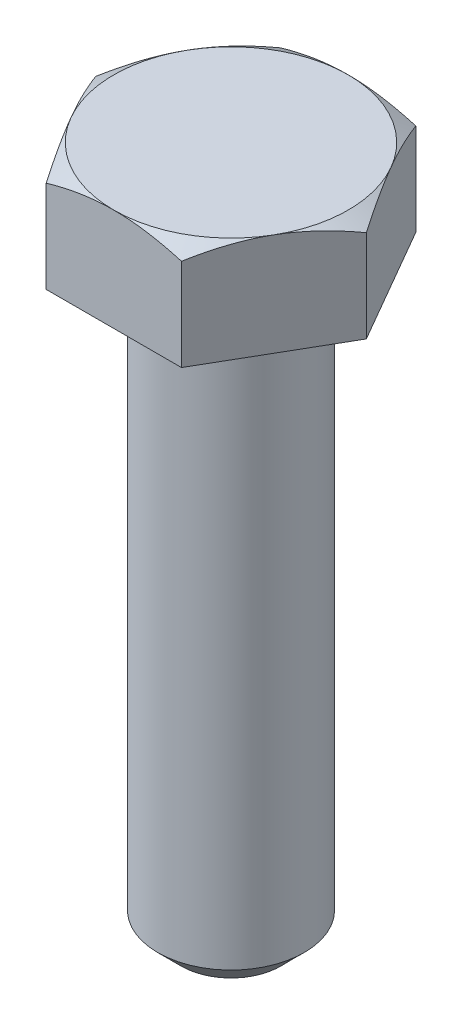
ISO-10303-21;
HEADER;
FILE_DESCRIPTION(('STEP AP214'),'2;1');
FILE_NAME('part.step','',(''),(''),'','','');
FILE_SCHEMA(('AUTOMOTIVE_DESIGN { 1 0 10303 214 1 1 1 1 }'));
ENDSEC;
DATA;
#1=APPLICATION_CONTEXT('core data for automotive mechanical design processes');
#2=APPLICATION_PROTOCOL_DEFINITION('international standard','automotive_design',2000,#1);
#3=PRODUCT_CONTEXT('',#1,'mechanical');
#4=PRODUCT('Part','Part','',(#3));
#5=PRODUCT_RELATED_PRODUCT_CATEGORY('part','',(#4));
#6=PRODUCT_DEFINITION_FORMATION('','',#4);
#7=PRODUCT_DEFINITION_CONTEXT('part definition',#1,'design');
#8=PRODUCT_DEFINITION('design','',#6,#7);
#9=PRODUCT_DEFINITION_SHAPE('','',#8);
#10=(LENGTH_UNIT() NAMED_UNIT(*) SI_UNIT(.MILLI.,.METRE.));
#11=(NAMED_UNIT(*) PLANE_ANGLE_UNIT() SI_UNIT($,.RADIAN.));
#12=(NAMED_UNIT(*) SI_UNIT($,.STERADIAN.) SOLID_ANGLE_UNIT());
#13=UNCERTAINTY_MEASURE_WITH_UNIT(LENGTH_MEASURE(1.E-05),#10,'distance_accuracy_value','');
#14=(GEOMETRIC_REPRESENTATION_CONTEXT(3) GLOBAL_UNCERTAINTY_ASSIGNED_CONTEXT((#13)) GLOBAL_UNIT_ASSIGNED_CONTEXT((#10,
#11,#12)) REPRESENTATION_CONTEXT('',''));
#15=CARTESIAN_POINT('',(0.,0.,0.));
#16=DIRECTION('',(0.,0.,1.));
#17=DIRECTION('',(1.,0.,0.));
#18=AXIS2_PLACEMENT_3D('',#15,#16,#17);
#19=CARTESIAN_POINT('',(0.,3.5,0.));
#20=DIRECTION('',(0.,-1.,0.));
#21=DIRECTION('',(1.,0.,0.));
#22=AXIS2_PLACEMENT_3D('',#19,#20,#21);
#23=PLANE('',#22);
#24=CARTESIAN_POINT('',(0.,3.50000000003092,0.));
#25=DIRECTION('',(0.,-1.,0.));
#26=DIRECTION('',(0.,0.,-1.));
#27=AXIS2_PLACEMENT_3D('',#24,#25,#26);
#28=CIRCLE('',#27,3.99999999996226);
#29=CARTESIAN_POINT('',(3.4641016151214,3.50000000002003,1.99999999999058));
#30=VERTEX_POINT('',#29);
#31=CARTESIAN_POINT('',(0.,3.50000000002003,3.99999999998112));
#32=VERTEX_POINT('',#31);
#33=EDGE_CURVE('E89',#30,#32,#28,.T.);
#34=ORIENTED_EDGE('',*,*,#33,.F.);
#35=CARTESIAN_POINT('',(0.,3.50000000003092,0.));
#36=DIRECTION('',(0.,-1.,0.));
#37=DIRECTION('',(0.,0.,-1.));
#38=AXIS2_PLACEMENT_3D('',#35,#36,#37);
#39=CIRCLE('',#38,3.99999999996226);
#40=CARTESIAN_POINT('',(3.4641016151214,3.50000000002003,-1.99999999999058));
#41=VERTEX_POINT('',#40);
#42=EDGE_CURVE('E87',#41,#30,#39,.T.);
#43=ORIENTED_EDGE('',*,*,#42,.F.);
#44=CARTESIAN_POINT('',(0.,3.50000000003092,0.));
#45=DIRECTION('',(0.,-1.,0.));
#46=DIRECTION('',(0.,0.,-1.));
#47=AXIS2_PLACEMENT_3D('',#44,#45,#46);
#48=CIRCLE('',#47,3.99999999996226);
#49=CARTESIAN_POINT('',(0.,3.50000000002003,-3.99999999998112));
#50=VERTEX_POINT('',#49);
#51=EDGE_CURVE('E20',#50,#41,#48,.T.);
#52=ORIENTED_EDGE('',*,*,#51,.F.);
#53=CARTESIAN_POINT('',(0.,3.50000000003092,0.));
#54=DIRECTION('',(0.,-1.,0.));
#55=DIRECTION('',(0.,0.,-1.));
#56=AXIS2_PLACEMENT_3D('',#53,#54,#55);
#57=CIRCLE('',#56,3.99999999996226);
#58=CARTESIAN_POINT('',(-3.4641016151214,3.50000000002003,-1.99999999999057));
#59=VERTEX_POINT('',#58);
#60=EDGE_CURVE('E104',#59,#50,#57,.T.);
#61=ORIENTED_EDGE('',*,*,#60,.F.);
#62=CARTESIAN_POINT('',(0.,3.50000000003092,0.));
#63=DIRECTION('',(0.,-1.,0.));
#64=DIRECTION('',(0.,0.,-1.));
#65=AXIS2_PLACEMENT_3D('',#62,#63,#64);
#66=CIRCLE('',#65,3.99999999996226);
#67=CARTESIAN_POINT('',(-3.4641016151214,3.50000000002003,1.99999999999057));
#68=VERTEX_POINT('',#67);
#69=EDGE_CURVE('E323',#68,#59,#66,.T.);
#70=ORIENTED_EDGE('',*,*,#69,.F.);
#71=CARTESIAN_POINT('',(0.,3.50000000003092,0.));
#72=DIRECTION('',(0.,-1.,0.));
#73=DIRECTION('',(0.,0.,-1.));
#74=AXIS2_PLACEMENT_3D('',#71,#72,#73);
#75=CIRCLE('',#74,3.99999999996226);
#76=EDGE_CURVE('E93',#32,#68,#75,.T.);
#77=ORIENTED_EDGE('',*,*,#76,.F.);
#78=EDGE_LOOP('',(#34,#43,#52,#61,#70,#77));
#79=FACE_BOUND('',#78,.T.);
#80=ADVANCED_FACE('F16',(#79),#23,.F.);
#81=CARTESIAN_POINT('',(0.,3.14059081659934,0.));
#82=DIRECTION('',(0.,-1.,0.));
#83=DIRECTION('',(0.,0.,-1.));
#84=AXIS2_PLACEMENT_3D('',#81,#82,#83);
#85=CONICAL_SURFACE('',#84,4.62251496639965,1.04719755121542);
#86=ORIENTED_EDGE('',*,*,#51,.T.);
#87=CARTESIAN_POINT('',(2.30940107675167,3.14273441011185,-4.00000000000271));
#88=CARTESIAN_POINT('',(2.4033932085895,3.19701440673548,-3.8372008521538));
#89=CARTESIAN_POINT('',(2.49813806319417,3.24674436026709,-3.67309795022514));
#90=CARTESIAN_POINT('',(2.68846293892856,3.33444223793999,-3.34344559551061));
#91=CARTESIAN_POINT('',(2.78403632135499,3.37246832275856,-3.17790764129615));
#92=CARTESIAN_POINT('',(2.92829837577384,3.41915789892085,-2.9280384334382));
#93=CARTESIAN_POINT('',(2.97656796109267,3.43300183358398,-2.84443305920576));
#94=CARTESIAN_POINT('',(3.07333821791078,3.45696597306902,-2.67682205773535));
#95=CARTESIAN_POINT('',(3.12183888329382,3.46708627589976,-2.59281644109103));
#96=CARTESIAN_POINT('',(3.21925069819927,3.48342533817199,-2.42409422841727));
#97=CARTESIAN_POINT('',(3.26816268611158,3.4896242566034,-2.33937618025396));
#98=CARTESIAN_POINT('',(3.36608285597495,3.49792016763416,-2.16977347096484));
#99=CARTESIAN_POINT('',(3.41509105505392,3.50001634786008,-2.08488878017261));
#100=CARTESIAN_POINT('',(3.46410161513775,3.50000000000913,-2.00000000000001));
#101=B_SPLINE_CURVE_WITH_KNOTS('',3,(#87,#88,#89,#90,#91,#92,#93,#94,#95,#96,#97,#98,#99,#100),
.UNSPECIFIED.,.F.,.F.,(4,2,2,2,2,2,4),(0.,0.587229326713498,1.17149154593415,1.4640059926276,
1.75651273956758,2.05048788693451,2.3445212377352),.UNSPECIFIED.);
#102=CARTESIAN_POINT('',(2.30940107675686,3.14273441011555,-4.00000000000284));
#103=VERTEX_POINT('',#102);
#104=EDGE_CURVE('E99',#103,#41,#101,.T.);
#105=ORIENTED_EDGE('',*,*,#104,.F.);
#106=CARTESIAN_POINT('',(0.,3.50000000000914,-3.99999999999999));
#107=CARTESIAN_POINT('',(0.0980211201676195,3.50001634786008,-3.99999999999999));
#108=CARTESIAN_POINT('',(0.196037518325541,3.49792016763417,-3.99999999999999));
#109=CARTESIAN_POINT('',(0.39187785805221,3.48962425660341,-3.99999999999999));
#110=CARTESIAN_POINT('',(0.489701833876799,3.48342533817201,-3.99999999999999));
#111=CARTESIAN_POINT('',(0.684525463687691,3.46708627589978,-3.99999999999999));
#112=CARTESIAN_POINT('',(0.781526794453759,3.45696597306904,-3.99999999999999));
#113=CARTESIAN_POINT('',(0.975067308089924,3.43300183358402,-3.99999999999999));
#114=CARTESIAN_POINT('',(1.07160647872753,3.41915789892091,-3.99999999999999));
#115=CARTESIAN_POINT('',(1.36013058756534,3.37246832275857,-3.99999999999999));
#116=CARTESIAN_POINT('',(1.55127735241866,3.33444223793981,-3.99999999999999));
#117=CARTESIAN_POINT('',(1.93192710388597,3.24674436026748,-3.99999999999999));
#118=CARTESIAN_POINT('',(2.12141681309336,3.19701440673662,-3.99999999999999));
#119=CARTESIAN_POINT('',(2.30940107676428,3.14273441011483,-3.99999999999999));
#120=B_SPLINE_CURVE_WITH_KNOTS('',3,(#106,#107,#108,#109,#110,#111,#112,#113,#114,#115,#116,
#117,#118,#119),.UNSPECIFIED.,.F.,.F.,(4,2,2,2,2,2,4),(0.,0.294033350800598,0.588008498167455,
0.880515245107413,1.17302969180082,1.75729191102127,2.34452123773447),.UNSPECIFIED.);
#121=EDGE_CURVE('E102',#50,#103,#120,.T.);
#122=ORIENTED_EDGE('',*,*,#121,.F.);
#123=EDGE_LOOP('',(#86,#105,#122));
#124=FACE_BOUND('',#123,.T.);
#125=ADVANCED_FACE('F97',(#124),#85,.T.);
#126=CARTESIAN_POINT('',(0.,3.14059081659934,0.));
#127=DIRECTION('',(0.,-1.,0.));
#128=DIRECTION('',(0.,0.,-1.));
#129=AXIS2_PLACEMENT_3D('',#126,#127,#128);
#130=CONICAL_SURFACE('',#129,4.62251496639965,1.04719755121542);
#131=ORIENTED_EDGE('',*,*,#60,.T.);
#132=CARTESIAN_POINT('',(-2.30940107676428,3.14273441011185,-3.99999999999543));
#133=CARTESIAN_POINT('',(-2.12141681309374,3.19701440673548,-3.9999999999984));
#134=CARTESIAN_POINT('',(-1.93192710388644,3.24674436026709,-3.99999999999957));
#135=CARTESIAN_POINT('',(-1.55127735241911,3.33444223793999,-4.0000000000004));
#136=CARTESIAN_POINT('',(-1.36013058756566,3.37246832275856,-4.00000000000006));
#137=CARTESIAN_POINT('',(-1.07160647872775,3.41915789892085,-3.99999999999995));
#138=CARTESIAN_POINT('',(-0.975067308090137,3.43300183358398,-3.99999999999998));
#139=CARTESIAN_POINT('',(-0.781526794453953,3.45696597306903,-4.));
#140=CARTESIAN_POINT('',(-0.684525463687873,3.46708627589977,-3.99999999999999));
#141=CARTESIAN_POINT('',(-0.489701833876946,3.483425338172,-3.99999999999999));
#142=CARTESIAN_POINT('',(-0.391877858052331,3.4896242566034,-3.99999999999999));
#143=CARTESIAN_POINT('',(-0.196037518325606,3.49792016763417,-3.99999999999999));
#144=CARTESIAN_POINT('',(-0.098021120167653,3.50001634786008,-3.99999999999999));
#145=CARTESIAN_POINT('',(0.,3.50000000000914,-3.99999999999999));
#146=B_SPLINE_CURVE_WITH_KNOTS('',3,(#132,#133,#134,#135,#136,#137,#138,#139,#140,#141,#142,
#143,#144,#145),.UNSPECIFIED.,.F.,.F.,(4,2,2,2,2,2,4),(0.,0.587229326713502,1.17149154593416,
1.46400599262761,1.75651273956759,2.05048788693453,2.34452123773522),.UNSPECIFIED.);
#147=CARTESIAN_POINT('',(-2.30940107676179,3.14273441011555,-3.99999999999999));
#148=VERTEX_POINT('',#147);
#149=EDGE_CURVE('E113',#148,#50,#146,.T.);
#150=ORIENTED_EDGE('',*,*,#149,.F.);
#151=CARTESIAN_POINT('',(-3.46410161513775,3.50000000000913,-2.00000000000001));
#152=CARTESIAN_POINT('',(-3.41509105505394,3.50001634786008,-2.08488878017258));
#153=CARTESIAN_POINT('',(-3.36608285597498,3.49792016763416,-2.16977347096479));
#154=CARTESIAN_POINT('',(-3.26816268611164,3.4896242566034,-2.33937618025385));
#155=CARTESIAN_POINT('',(-3.21925069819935,3.483425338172,-2.42409422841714));
#156=CARTESIAN_POINT('',(-3.1218388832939,3.46708627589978,-2.59281644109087));
#157=CARTESIAN_POINT('',(-3.07333821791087,3.45696597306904,-2.67682205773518));
#158=CARTESIAN_POINT('',(-2.97656796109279,3.43300183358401,-2.84443305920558));
#159=CARTESIAN_POINT('',(-2.92829837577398,3.41915789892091,-2.92803843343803));
#160=CARTESIAN_POINT('',(-2.78403632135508,3.37246832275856,-3.17790764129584));
#161=CARTESIAN_POINT('',(-2.68846293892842,3.33444223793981,-3.34344559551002));
#162=CARTESIAN_POINT('',(-2.49813806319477,3.24674436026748,-3.67309795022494));
#163=CARTESIAN_POINT('',(-2.40339320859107,3.19701440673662,-3.83720085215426));
#164=CARTESIAN_POINT('',(-2.30940107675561,3.14273441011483,-4.00000000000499));
#165=B_SPLINE_CURVE_WITH_KNOTS('',3,(#151,#152,#153,#154,#155,#156,#157,#158,#159,#160,#161,
#162,#163,#164),.UNSPECIFIED.,.F.,.F.,(4,2,2,2,2,2,4),(0.,0.294033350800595,0.58800849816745,
0.880515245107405,1.17302969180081,1.75729191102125,2.34452123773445),.UNSPECIFIED.);
#166=EDGE_CURVE('E169',#59,#148,#165,.T.);
#167=ORIENTED_EDGE('',*,*,#166,.F.);
#168=EDGE_LOOP('',(#131,#150,#167));
#169=FACE_BOUND('',#168,.T.);
#170=ADVANCED_FACE('F137',(#169),#130,.T.);
#171=CARTESIAN_POINT('',(0.,3.14059081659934,0.));
#172=DIRECTION('',(0.,-1.,0.));
#173=DIRECTION('',(0.,0.,-1.));
#174=AXIS2_PLACEMENT_3D('',#171,#172,#173);
#175=CONICAL_SURFACE('',#174,4.62251496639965,1.04719755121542);
#176=ORIENTED_EDGE('',*,*,#69,.T.);
#177=CARTESIAN_POINT('',(-4.61880215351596,3.14273441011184,7.2818296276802E-12));
#178=CARTESIAN_POINT('',(-4.52481002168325,3.19701440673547,-0.162799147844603));
#179=CARTESIAN_POINT('',(-4.43006516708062,3.24674436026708,-0.326902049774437));
#180=CARTESIAN_POINT('',(-4.23974029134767,3.33444223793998,-0.656554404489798));
#181=CARTESIAN_POINT('',(-4.14416690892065,3.37246832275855,-0.822092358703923));
#182=CARTESIAN_POINT('',(-3.9999048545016,3.41915789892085,-1.07196156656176));
#183=CARTESIAN_POINT('',(-3.95163526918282,3.43300183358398,-1.15556694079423));
#184=CARTESIAN_POINT('',(-3.85486501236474,3.45696597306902,-1.32317794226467));
#185=CARTESIAN_POINT('',(-3.80636434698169,3.46708627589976,-1.40718355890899));
#186=CARTESIAN_POINT('',(-3.70895253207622,3.48342533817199,-1.57590577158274));
#187=CARTESIAN_POINT('',(-3.66004054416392,3.4896242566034,-1.66062381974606));
#188=CARTESIAN_POINT('',(-3.56212037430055,3.49792016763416,-1.83022652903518));
#189=CARTESIAN_POINT('',(-3.51311217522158,3.50001634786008,-1.91511121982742));
#190=CARTESIAN_POINT('',(-3.46410161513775,3.50000000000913,-2.00000000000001));
#191=B_SPLINE_CURVE_WITH_KNOTS('',3,(#177,#178,#179,#180,#181,#182,#183,#184,#185,#186,#187,
#188,#189,#190),.UNSPECIFIED.,.F.,.F.,(4,2,2,2,2,2,4),(0.,0.587229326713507,1.17149154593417,
1.46400599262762,1.75651273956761,2.05048788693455,2.34452123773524),.UNSPECIFIED.);
#192=CARTESIAN_POINT('',(-4.61880215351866,3.14273441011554,2.84537209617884E-12));
#193=VERTEX_POINT('',#192);
#194=EDGE_CURVE('E146',#193,#59,#191,.T.);
#195=ORIENTED_EDGE('',*,*,#194,.F.);
#196=CARTESIAN_POINT('',(-3.46410161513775,3.50000000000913,2.00000000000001));
#197=CARTESIAN_POINT('',(-3.51311217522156,3.50001634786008,1.91511121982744));
#198=CARTESIAN_POINT('',(-3.56212037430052,3.49792016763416,1.83022652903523));
#199=CARTESIAN_POINT('',(-3.66004054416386,3.4896242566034,1.66062381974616));
#200=CARTESIAN_POINT('',(-3.70895253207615,3.483425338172,1.57590577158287));
#201=CARTESIAN_POINT('',(-3.8063643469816,3.46708627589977,1.40718355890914));
#202=CARTESIAN_POINT('',(-3.85486501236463,3.45696597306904,1.32317794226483));
#203=CARTESIAN_POINT('',(-3.95163526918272,3.43300183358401,1.15556694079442));
#204=CARTESIAN_POINT('',(-3.99990485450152,3.4191578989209,1.07196156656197));
#205=CARTESIAN_POINT('',(-4.14416690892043,3.37246832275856,0.822092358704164));
#206=CARTESIAN_POINT('',(-4.23974029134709,3.3344422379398,0.656554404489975));
#207=CARTESIAN_POINT('',(-4.43006516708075,3.24674436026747,0.326902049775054));
#208=CARTESIAN_POINT('',(-4.52481002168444,3.19701440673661,0.162799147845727));
#209=CARTESIAN_POINT('',(-4.6188021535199,3.14273441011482,-5.00231021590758E-12));
#210=B_SPLINE_CURVE_WITH_KNOTS('',3,(#196,#197,#198,#199,#200,#201,#202,#203,#204,#205,#206,
#207,#208,#209),.UNSPECIFIED.,.F.,.F.,(4,2,2,2,2,2,4),(0.,0.294033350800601,0.58800849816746,
0.880515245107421,1.17302969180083,1.75729191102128,2.34452123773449),.UNSPECIFIED.);
#211=EDGE_CURVE('E183',#68,#193,#210,.T.);
#212=ORIENTED_EDGE('',*,*,#211,.F.);
#213=EDGE_LOOP('',(#176,#195,#212));
#214=FACE_BOUND('',#213,.T.);
#215=ADVANCED_FACE('F191',(#214),#175,.T.);
#216=CARTESIAN_POINT('',(0.,3.14059081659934,0.));
#217=DIRECTION('',(0.,-1.,0.));
#218=DIRECTION('',(0.,0.,-1.));
#219=AXIS2_PLACEMENT_3D('',#216,#217,#218);
#220=CONICAL_SURFACE('',#219,4.62251496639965,1.04719755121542);
#221=ORIENTED_EDGE('',*,*,#76,.T.);
#222=CARTESIAN_POINT('',(-2.30940107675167,3.14273441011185,4.00000000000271));
#223=CARTESIAN_POINT('',(-2.40339320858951,3.19701440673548,3.8372008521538));
#224=CARTESIAN_POINT('',(-2.49813806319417,3.24674436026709,3.67309795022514));
#225=CARTESIAN_POINT('',(-2.68846293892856,3.33444223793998,3.34344559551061));
#226=CARTESIAN_POINT('',(-2.78403632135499,3.37246832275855,3.17790764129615));
#227=CARTESIAN_POINT('',(-2.92829837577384,3.41915789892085,2.9280384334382));
#228=CARTESIAN_POINT('',(-2.97656796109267,3.43300183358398,2.84443305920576));
#229=CARTESIAN_POINT('',(-3.07333821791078,3.45696597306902,2.67682205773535));
#230=CARTESIAN_POINT('',(-3.12183888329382,3.46708627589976,2.59281644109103));
#231=CARTESIAN_POINT('',(-3.21925069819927,3.48342533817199,2.42409422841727));
#232=CARTESIAN_POINT('',(-3.26816268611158,3.4896242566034,2.33937618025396));
#233=CARTESIAN_POINT('',(-3.36608285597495,3.49792016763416,2.16977347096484));
#234=CARTESIAN_POINT('',(-3.41509105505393,3.50001634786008,2.08488878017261));
#235=CARTESIAN_POINT('',(-3.46410161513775,3.50000000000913,2.00000000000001));
#236=B_SPLINE_CURVE_WITH_KNOTS('',3,(#222,#223,#224,#225,#226,#227,#228,#229,#230,#231,#232,
#233,#234,#235),.UNSPECIFIED.,.F.,.F.,(4,2,2,2,2,2,4),(0.,0.587229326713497,1.17149154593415,
1.4640059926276,1.75651273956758,2.05048788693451,2.3445212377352),.UNSPECIFIED.);
#237=CARTESIAN_POINT('',(-2.30940107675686,3.14273441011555,4.00000000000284));
#238=VERTEX_POINT('',#237);
#239=EDGE_CURVE('E176',#238,#68,#236,.T.);
#240=ORIENTED_EDGE('',*,*,#239,.F.);
#241=CARTESIAN_POINT('',(0.,3.50000000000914,3.99999999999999));
#242=CARTESIAN_POINT('',(-0.0980211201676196,3.50001634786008,3.99999999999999));
#243=CARTESIAN_POINT('',(-0.196037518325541,3.49792016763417,3.99999999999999));
#244=CARTESIAN_POINT('',(-0.39187785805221,3.48962425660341,3.99999999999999));
#245=CARTESIAN_POINT('',(-0.489701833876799,3.48342533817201,3.99999999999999));
#246=CARTESIAN_POINT('',(-0.684525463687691,3.46708627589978,3.99999999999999));
#247=CARTESIAN_POINT('',(-0.78152679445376,3.45696597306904,3.99999999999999));
#248=CARTESIAN_POINT('',(-0.975067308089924,3.43300183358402,3.99999999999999));
#249=CARTESIAN_POINT('',(-1.07160647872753,3.41915789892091,3.99999999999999));
#250=CARTESIAN_POINT('',(-1.36013058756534,3.37246832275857,3.99999999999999));
#251=CARTESIAN_POINT('',(-1.55127735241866,3.33444223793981,3.99999999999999));
#252=CARTESIAN_POINT('',(-1.93192710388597,3.24674436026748,3.99999999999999));
#253=CARTESIAN_POINT('',(-2.12141681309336,3.19701440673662,3.99999999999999));
#254=CARTESIAN_POINT('',(-2.30940107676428,3.14273441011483,3.99999999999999));
#255=B_SPLINE_CURVE_WITH_KNOTS('',3,(#241,#242,#243,#244,#245,#246,#247,#248,#249,#250,#251,
#252,#253,#254),.UNSPECIFIED.,.F.,.F.,(4,2,2,2,2,2,4),(0.,0.294033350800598,0.588008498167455,
0.880515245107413,1.17302969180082,1.75729191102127,2.34452123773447),.UNSPECIFIED.);
#256=EDGE_CURVE('E198',#32,#238,#255,.T.);
#257=ORIENTED_EDGE('',*,*,#256,.F.);
#258=EDGE_LOOP('',(#221,#240,#257));
#259=FACE_BOUND('',#258,.T.);
#260=ADVANCED_FACE('F188',(#259),#220,.T.);
#261=CARTESIAN_POINT('',(0.,3.14059081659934,0.));
#262=DIRECTION('',(0.,-1.,0.));
#263=DIRECTION('',(0.,0.,-1.));
#264=AXIS2_PLACEMENT_3D('',#261,#262,#263);
#265=CONICAL_SURFACE('',#264,4.62251496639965,1.04719755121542);
#266=ORIENTED_EDGE('',*,*,#42,.T.);
#267=CARTESIAN_POINT('',(4.61880215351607,3.1427344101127,-5.88236889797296E-12));
#268=CARTESIAN_POINT('',(4.52481002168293,3.19701440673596,0.16279914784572));
#269=CARTESIAN_POINT('',(4.43006516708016,3.24674436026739,0.326902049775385));
#270=CARTESIAN_POINT('',(4.23974029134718,3.33444223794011,0.656554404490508));
#271=CARTESIAN_POINT('',(4.14416690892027,3.37246832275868,0.822092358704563));
#272=CARTESIAN_POINT('',(3.99990485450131,3.41915789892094,1.07196156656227));
#273=CARTESIAN_POINT('',(3.95163526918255,3.43300183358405,1.1555669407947));
#274=CARTESIAN_POINT('',(3.85486501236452,3.45696597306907,1.32317794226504));
#275=CARTESIAN_POINT('',(3.8063643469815,3.4670862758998,1.40718355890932));
#276=CARTESIAN_POINT('',(3.70895253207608,3.48342533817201,1.57590577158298));
#277=CARTESIAN_POINT('',(3.6600405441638,3.48962425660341,1.66062381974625));
#278=CARTESIAN_POINT('',(3.5621203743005,3.49792016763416,1.83022652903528));
#279=CARTESIAN_POINT('',(3.51311217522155,3.50001634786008,1.91511121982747));
#280=CARTESIAN_POINT('',(3.46410161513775,3.50000000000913,2.00000000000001));
#281=B_SPLINE_CURVE_WITH_KNOTS('',3,(#267,#268,#269,#270,#271,#272,#273,#274,#275,#276,#277,
#278,#279,#280),.UNSPECIFIED.,.F.,.F.,(4,2,2,2,2,2,4),(0.,0.587229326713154,1.17149154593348,
1.46400599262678,1.75651273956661,2.05048788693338,2.34452123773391),.UNSPECIFIED.);
#282=CARTESIAN_POINT('',(4.61880215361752,3.14273441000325,2.28554564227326E-12));
#283=VERTEX_POINT('',#282);
#284=EDGE_CURVE('E109',#283,#30,#281,.T.);
#285=ORIENTED_EDGE('',*,*,#284,.F.);
#286=CARTESIAN_POINT('',(3.46410161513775,3.50000000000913,-2.00000000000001));
#287=CARTESIAN_POINT('',(3.51311217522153,3.50001634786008,-1.91511121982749));
#288=CARTESIAN_POINT('',(3.56212037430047,3.49792016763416,-1.83022652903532));
#289=CARTESIAN_POINT('',(3.66004054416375,3.48962425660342,-1.66062381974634));
#290=CARTESIAN_POINT('',(3.70895253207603,3.48342533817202,-1.57590577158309));
#291=CARTESIAN_POINT('',(3.80636434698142,3.46708627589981,-1.40718355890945));
#292=CARTESIAN_POINT('',(3.85486501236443,3.45696597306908,-1.32317794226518));
#293=CARTESIAN_POINT('',(3.95163526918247,3.43300183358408,-1.15556694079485));
#294=CARTESIAN_POINT('',(3.99990485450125,3.41915789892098,-1.07196156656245));
#295=CARTESIAN_POINT('',(4.14416690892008,3.37246832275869,-0.82209235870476));
#296=CARTESIAN_POINT('',(4.2397402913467,3.33444223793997,-0.656554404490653));
#297=CARTESIAN_POINT('',(4.43006516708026,3.24674436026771,-0.326902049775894));
#298=CARTESIAN_POINT('',(4.52481002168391,3.1970144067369,-0.162799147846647));
#299=CARTESIAN_POINT('',(4.61880215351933,3.14273441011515,4.0037334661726E-12));
#300=B_SPLINE_CURVE_WITH_KNOTS('',3,(#286,#287,#288,#289,#290,#291,#292,#293,#294,#295,#296,
#297,#298,#299),.UNSPECIFIED.,.F.,.F.,(4,2,2,2,2,2,4),(0.,0.294033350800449,0.588008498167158,
0.880515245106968,1.17302969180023,1.75729191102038,2.34452123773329),.UNSPECIFIED.);
#301=EDGE_CURVE('E106',#41,#283,#300,.T.);
#302=ORIENTED_EDGE('',*,*,#301,.F.);
#303=EDGE_LOOP('',(#266,#285,#302));
#304=FACE_BOUND('',#303,.T.);
#305=ADVANCED_FACE('F107',(#304),#265,.T.);
#306=CARTESIAN_POINT('',(0.,3.14059081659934,0.));
#307=DIRECTION('',(0.,-1.,0.));
#308=DIRECTION('',(0.,0.,-1.));
#309=AXIS2_PLACEMENT_3D('',#306,#307,#308);
#310=CONICAL_SURFACE('',#309,4.62251496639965,1.04719755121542);
#311=ORIENTED_EDGE('',*,*,#33,.T.);
#312=CARTESIAN_POINT('',(2.30940107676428,3.14273441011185,3.99999999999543));
#313=CARTESIAN_POINT('',(2.12141681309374,3.19701440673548,3.9999999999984));
#314=CARTESIAN_POINT('',(1.93192710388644,3.24674436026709,3.99999999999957));
#315=CARTESIAN_POINT('',(1.5512773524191,3.33444223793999,4.0000000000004));
#316=CARTESIAN_POINT('',(1.36013058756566,3.37246832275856,4.00000000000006));
#317=CARTESIAN_POINT('',(1.07160647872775,3.41915789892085,3.99999999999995));
#318=CARTESIAN_POINT('',(0.975067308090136,3.43300183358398,3.99999999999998));
#319=CARTESIAN_POINT('',(0.781526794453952,3.45696597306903,4.));
#320=CARTESIAN_POINT('',(0.684525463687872,3.46708627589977,3.99999999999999));
#321=CARTESIAN_POINT('',(0.489701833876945,3.483425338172,3.99999999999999));
#322=CARTESIAN_POINT('',(0.39187785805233,3.4896242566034,3.99999999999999));
#323=CARTESIAN_POINT('',(0.196037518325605,3.49792016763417,3.99999999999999));
#324=CARTESIAN_POINT('',(0.0980211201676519,3.50001634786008,3.99999999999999));
#325=CARTESIAN_POINT('',(0.,3.50000000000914,3.99999999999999));
#326=B_SPLINE_CURVE_WITH_KNOTS('',3,(#312,#313,#314,#315,#316,#317,#318,#319,#320,#321,#322,
#323,#324,#325),.UNSPECIFIED.,.F.,.F.,(4,2,2,2,2,2,4),(0.,0.587229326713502,1.17149154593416,
1.46400599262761,1.7565127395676,2.05048788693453,2.34452123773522),.UNSPECIFIED.);
#327=CARTESIAN_POINT('',(2.30940107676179,3.14273441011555,3.99999999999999));
#328=VERTEX_POINT('',#327);
#329=EDGE_CURVE('E205',#328,#32,#326,.T.);
#330=ORIENTED_EDGE('',*,*,#329,.F.);
#331=CARTESIAN_POINT('',(3.46410161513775,3.50000000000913,2.00000000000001));
#332=CARTESIAN_POINT('',(3.41509105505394,3.50001634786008,2.08488878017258));
#333=CARTESIAN_POINT('',(3.36608285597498,3.49792016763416,2.16977347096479));
#334=CARTESIAN_POINT('',(3.26816268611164,3.4896242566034,2.33937618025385));
#335=CARTESIAN_POINT('',(3.21925069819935,3.483425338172,2.42409422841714));
#336=CARTESIAN_POINT('',(3.1218388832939,3.46708627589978,2.59281644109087));
#337=CARTESIAN_POINT('',(3.07333821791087,3.45696597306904,2.67682205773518));
#338=CARTESIAN_POINT('',(2.97656796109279,3.43300183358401,2.84443305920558));
#339=CARTESIAN_POINT('',(2.92829837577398,3.41915789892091,2.92803843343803));
#340=CARTESIAN_POINT('',(2.78403632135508,3.37246832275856,3.17790764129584));
#341=CARTESIAN_POINT('',(2.68846293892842,3.33444223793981,3.34344559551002));
#342=CARTESIAN_POINT('',(2.49813806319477,3.24674436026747,3.67309795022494));
#343=CARTESIAN_POINT('',(2.40339320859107,3.19701440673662,3.83720085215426));
#344=CARTESIAN_POINT('',(2.30940107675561,3.14273441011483,4.00000000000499));
#345=B_SPLINE_CURVE_WITH_KNOTS('',3,(#331,#332,#333,#334,#335,#336,#337,#338,#339,#340,#341,
#342,#343,#344),.UNSPECIFIED.,.F.,.F.,(4,2,2,2,2,2,4),(0.,0.294033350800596,0.58800849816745,
0.880515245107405,1.17302969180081,1.75729191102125,2.34452123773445),.UNSPECIFIED.);
#346=EDGE_CURVE('E225',#30,#328,#345,.T.);
#347=ORIENTED_EDGE('',*,*,#346,.F.);
#348=EDGE_LOOP('',(#311,#330,#347));
#349=FACE_BOUND('',#348,.T.);
#350=ADVANCED_FACE('F233',(#349),#310,.T.);
#351=CARTESIAN_POINT('',(0.,-20.,0.));
#352=DIRECTION('',(0.,1.,0.));
#353=DIRECTION('',(0.,0.,1.));
#354=AXIS2_PLACEMENT_3D('',#351,#352,#353);
#355=PLANE('',#354);
#356=CARTESIAN_POINT('',(0.,-20.0000000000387,0.));
#357=DIRECTION('',(0.,1.,0.));
#358=DIRECTION('',(0.,0.,1.));
#359=AXIS2_PLACEMENT_3D('',#356,#357,#358);
#360=CIRCLE('',#359,1.70000000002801);
#361=CARTESIAN_POINT('',(0.,-20.0000000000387,1.70000000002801));
#362=VERTEX_POINT('',#361);
#363=EDGE_CURVE('E232',#362,#362,#360,.T.);
#364=ORIENTED_EDGE('',*,*,#363,.F.);
#365=EDGE_LOOP('',(#364));
#366=FACE_BOUND('',#365,.T.);
#367=ADVANCED_FACE('F236',(#366),#355,.F.);
#368=CARTESIAN_POINT('',(2.3094010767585,19.66,-3.99999999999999));
#369=DIRECTION('',(0.866025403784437,0.,-0.500000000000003));
#370=DIRECTION('',(-0.500000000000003,0.,-0.866025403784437));
#371=AXIS2_PLACEMENT_3D('',#368,#369,#370);
#372=PLANE('',#371);
#373=DIRECTION('',(-0.500000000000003,0.,-0.866025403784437));
#374=VECTOR('',#373,1.);
#375=CARTESIAN_POINT('',(4.61880215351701,0.,0.));
#376=LINE('',#375,#374);
#377=CARTESIAN_POINT('',(4.61880215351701,0.,0.));
#378=VERTEX_POINT('',#377);
#379=CARTESIAN_POINT('',(2.3094010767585,0.,-3.99999999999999));
#380=VERTEX_POINT('',#379);
#381=EDGE_CURVE('E269',#378,#380,#376,.T.);
#382=ORIENTED_EDGE('',*,*,#381,.T.);
#383=DIRECTION('',(0.,1.,0.));
#384=VECTOR('',#383,1.);
#385=CARTESIAN_POINT('',(2.3094010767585,19.66,-3.99999999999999));
#386=LINE('',#385,#384);
#387=EDGE_CURVE('E117',#103,#380,#386,.F.);
#388=ORIENTED_EDGE('',*,*,#387,.F.);
#389=ORIENTED_EDGE('',*,*,#104,.T.);
#390=ORIENTED_EDGE('',*,*,#301,.T.);
#391=DIRECTION('',(0.,1.,0.));
#392=VECTOR('',#391,1.);
#393=CARTESIAN_POINT('',(4.61880215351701,19.66,0.));
#394=LINE('',#393,#392);
#395=EDGE_CURVE('E312',#378,#283,#394,.T.);
#396=ORIENTED_EDGE('',*,*,#395,.F.);
#397=EDGE_LOOP('',(#382,#388,#389,#390,#396));
#398=FACE_BOUND('',#397,.T.);
#399=ADVANCED_FACE('F115',(#398),#372,.T.);
#400=CARTESIAN_POINT('',(-2.3094010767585,19.66,-3.99999999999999));
#401=DIRECTION('',(0.,0.,-1.));
#402=DIRECTION('',(-1.,0.,0.));
#403=AXIS2_PLACEMENT_3D('',#400,#401,#402);
#404=PLANE('',#403);
#405=DIRECTION('',(-1.,0.,0.));
#406=VECTOR('',#405,1.);
#407=CARTESIAN_POINT('',(0.,0.,-3.99999999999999));
#408=LINE('',#407,#406);
#409=CARTESIAN_POINT('',(-2.3094010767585,0.,-3.99999999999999));
#410=VERTEX_POINT('',#409);
#411=EDGE_CURVE('E271',#380,#410,#408,.T.);
#412=ORIENTED_EDGE('',*,*,#411,.T.);
#413=DIRECTION('',(0.,1.,0.));
#414=VECTOR('',#413,1.);
#415=CARTESIAN_POINT('',(-2.3094010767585,19.66,-3.99999999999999));
#416=LINE('',#415,#414);
#417=EDGE_CURVE('E175',#148,#410,#416,.F.);
#418=ORIENTED_EDGE('',*,*,#417,.F.);
#419=ORIENTED_EDGE('',*,*,#149,.T.);
#420=ORIENTED_EDGE('',*,*,#121,.T.);
#421=ORIENTED_EDGE('',*,*,#387,.T.);
#422=EDGE_LOOP('',(#412,#418,#419,#420,#421));
#423=FACE_BOUND('',#422,.T.);
#424=ADVANCED_FACE('F155',(#423),#404,.T.);
#425=CARTESIAN_POINT('',(-2.3094010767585,19.66,-3.99999999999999));
#426=DIRECTION('',(-0.866025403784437,0.,-0.500000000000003));
#427=DIRECTION('',(-0.500000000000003,0.,0.866025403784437));
#428=AXIS2_PLACEMENT_3D('',#425,#426,#427);
#429=PLANE('',#428);
#430=DIRECTION('',(-0.500000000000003,0.,0.866025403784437));
#431=VECTOR('',#430,1.);
#432=CARTESIAN_POINT('',(-2.3094010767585,0.,-3.99999999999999));
#433=LINE('',#432,#431);
#434=CARTESIAN_POINT('',(-4.61880215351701,0.,0.));
#435=VERTEX_POINT('',#434);
#436=EDGE_CURVE('E279',#410,#435,#433,.T.);
#437=ORIENTED_EDGE('',*,*,#436,.T.);
#438=DIRECTION('',(0.,1.,0.));
#439=VECTOR('',#438,1.);
#440=CARTESIAN_POINT('',(-4.61880215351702,19.66,0.));
#441=LINE('',#440,#439);
#442=EDGE_CURVE('E302',#193,#435,#441,.F.);
#443=ORIENTED_EDGE('',*,*,#442,.F.);
#444=ORIENTED_EDGE('',*,*,#194,.T.);
#445=ORIENTED_EDGE('',*,*,#166,.T.);
#446=ORIENTED_EDGE('',*,*,#417,.T.);
#447=EDGE_LOOP('',(#437,#443,#444,#445,#446));
#448=FACE_BOUND('',#447,.T.);
#449=ADVANCED_FACE('F158',(#448),#429,.T.);
#450=CARTESIAN_POINT('',(-2.3094010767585,19.66,3.99999999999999));
#451=DIRECTION('',(-0.866025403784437,0.,0.500000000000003));
#452=DIRECTION('',(0.500000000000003,0.,0.866025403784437));
#453=AXIS2_PLACEMENT_3D('',#450,#451,#452);
#454=PLANE('',#453);
#455=DIRECTION('',(0.500000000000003,0.,0.866025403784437));
#456=VECTOR('',#455,1.);
#457=CARTESIAN_POINT('',(-4.61880215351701,0.,0.));
#458=LINE('',#457,#456);
#459=CARTESIAN_POINT('',(-2.3094010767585,0.,3.99999999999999));
#460=VERTEX_POINT('',#459);
#461=EDGE_CURVE('E275',#435,#460,#458,.T.);
#462=ORIENTED_EDGE('',*,*,#461,.T.);
#463=DIRECTION('',(0.,1.,0.));
#464=VECTOR('',#463,1.);
#465=CARTESIAN_POINT('',(-2.3094010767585,19.66,3.99999999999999));
#466=LINE('',#465,#464);
#467=EDGE_CURVE('E204',#238,#460,#466,.F.);
#468=ORIENTED_EDGE('',*,*,#467,.F.);
#469=ORIENTED_EDGE('',*,*,#239,.T.);
#470=ORIENTED_EDGE('',*,*,#211,.T.);
#471=ORIENTED_EDGE('',*,*,#442,.T.);
#472=EDGE_LOOP('',(#462,#468,#469,#470,#471));
#473=FACE_BOUND('',#472,.T.);
#474=ADVANCED_FACE('F164',(#473),#454,.T.);
#475=CARTESIAN_POINT('',(-2.3094010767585,19.66,3.99999999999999));
#476=DIRECTION('',(0.,0.,1.));
#477=DIRECTION('',(1.,0.,0.));
#478=AXIS2_PLACEMENT_3D('',#475,#476,#477);
#479=PLANE('',#478);
#480=DIRECTION('',(-1.,0.,0.));
#481=VECTOR('',#480,1.);
#482=CARTESIAN_POINT('',(0.,0.,3.99999999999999));
#483=LINE('',#482,#481);
#484=CARTESIAN_POINT('',(2.3094010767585,0.,3.99999999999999));
#485=VERTEX_POINT('',#484);
#486=EDGE_CURVE('E35',#460,#485,#483,.F.);
#487=ORIENTED_EDGE('',*,*,#486,.T.);
#488=DIRECTION('',(0.,1.,0.));
#489=VECTOR('',#488,1.);
#490=CARTESIAN_POINT('',(2.3094010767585,19.66,3.99999999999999));
#491=LINE('',#490,#489);
#492=EDGE_CURVE('E231',#328,#485,#491,.F.);
#493=ORIENTED_EDGE('',*,*,#492,.F.);
#494=ORIENTED_EDGE('',*,*,#329,.T.);
#495=ORIENTED_EDGE('',*,*,#256,.T.);
#496=ORIENTED_EDGE('',*,*,#467,.T.);
#497=EDGE_LOOP('',(#487,#493,#494,#495,#496));
#498=FACE_BOUND('',#497,.T.);
#499=ADVANCED_FACE('F214',(#498),#479,.T.);
#500=CARTESIAN_POINT('',(2.3094010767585,19.66,3.99999999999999));
#501=DIRECTION('',(0.866025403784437,0.,0.500000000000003));
#502=DIRECTION('',(0.500000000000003,0.,-0.866025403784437));
#503=AXIS2_PLACEMENT_3D('',#500,#501,#502);
#504=PLANE('',#503);
#505=DIRECTION('',(0.500000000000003,0.,-0.866025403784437));
#506=VECTOR('',#505,1.);
#507=CARTESIAN_POINT('',(2.3094010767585,0.,3.99999999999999));
#508=LINE('',#507,#506);
#509=EDGE_CURVE('E259',#485,#378,#508,.T.);
#510=ORIENTED_EDGE('',*,*,#509,.T.);
#511=ORIENTED_EDGE('',*,*,#395,.T.);
#512=ORIENTED_EDGE('',*,*,#284,.T.);
#513=ORIENTED_EDGE('',*,*,#346,.T.);
#514=ORIENTED_EDGE('',*,*,#492,.T.);
#515=EDGE_LOOP('',(#510,#511,#512,#513,#514));
#516=FACE_BOUND('',#515,.T.);
#517=ADVANCED_FACE('F217',(#516),#504,.T.);
#518=CARTESIAN_POINT('',(0.,-19.2000000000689,0.));
#519=DIRECTION('',(0.,1.,0.));
#520=DIRECTION('',(0.,0.,1.));
#521=AXIS2_PLACEMENT_3D('',#518,#519,#520);
#522=CONICAL_SURFACE('',#521,2.49999999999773,0.785398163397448);
#523=ORIENTED_EDGE('',*,*,#363,.T.);
#524=EDGE_LOOP('',(#523));
#525=FACE_BOUND('',#524,.T.);
#526=CARTESIAN_POINT('',(0.,-19.2,0.));
#527=DIRECTION('',(0.,1.,0.));
#528=DIRECTION('',(0.,0.,1.));
#529=AXIS2_PLACEMENT_3D('',#526,#527,#528);
#530=CIRCLE('',#529,2.5);
#531=CARTESIAN_POINT('',(0.,-19.2,2.5));
#532=VERTEX_POINT('',#531);
#533=EDGE_CURVE('E26',#532,#532,#530,.T.);
#534=ORIENTED_EDGE('',*,*,#533,.F.);
#535=EDGE_LOOP('',(#534));
#536=FACE_BOUND('',#535,.T.);
#537=ADVANCED_FACE('F222',(#525,#536),#522,.T.);
#538=CARTESIAN_POINT('',(0.,0.,0.));
#539=DIRECTION('',(0.,1.,0.));
#540=DIRECTION('',(-1.,0.,0.));
#541=AXIS2_PLACEMENT_3D('',#538,#539,#540);
#542=PLANE('',#541);
#543=ORIENTED_EDGE('',*,*,#486,.F.);
#544=ORIENTED_EDGE('',*,*,#461,.F.);
#545=ORIENTED_EDGE('',*,*,#436,.F.);
#546=ORIENTED_EDGE('',*,*,#411,.F.);
#547=ORIENTED_EDGE('',*,*,#381,.F.);
#548=ORIENTED_EDGE('',*,*,#509,.F.);
#549=EDGE_LOOP('',(#543,#544,#545,#546,#547,#548));
#550=FACE_BOUND('',#549,.T.);
#551=CARTESIAN_POINT('',(0.,0.,0.));
#552=DIRECTION('',(0.,1.,0.));
#553=DIRECTION('',(0.,0.,1.));
#554=AXIS2_PLACEMENT_3D('',#551,#552,#553);
#555=CIRCLE('',#554,2.5);
#556=CARTESIAN_POINT('',(0.,0.,2.5));
#557=VERTEX_POINT('',#556);
#558=EDGE_CURVE('E10',#557,#557,#555,.F.);
#559=ORIENTED_EDGE('',*,*,#558,.F.);
#560=EDGE_LOOP('',(#559));
#561=FACE_BOUND('',#560,.T.);
#562=ADVANCED_FACE('F247',(#550,#561),#542,.F.);
#563=CARTESIAN_POINT('',(0.,-20.,0.));
#564=DIRECTION('',(0.,1.,0.));
#565=DIRECTION('',(0.,0.,1.));
#566=AXIS2_PLACEMENT_3D('',#563,#564,#565);
#567=CYLINDRICAL_SURFACE('',#566,2.5);
#568=ORIENTED_EDGE('',*,*,#533,.T.);
#569=EDGE_LOOP('',(#568));
#570=FACE_BOUND('',#569,.T.);
#571=ORIENTED_EDGE('',*,*,#558,.T.);
#572=EDGE_LOOP('',(#571));
#573=FACE_BOUND('',#572,.T.);
#574=ADVANCED_FACE('F18',(#570,#573),#567,.T.);
#575=CLOSED_SHELL('',(#80,#125,#170,#215,#260,#305,#350,#367,#399,#424,#449,#474,#499,#517,#537,
#562,#574));
#576=MANIFOLD_SOLID_BREP('B1',#575);
#577=ADVANCED_BREP_SHAPE_REPRESENTATION('',(#18,#576),#14);
#578=SHAPE_DEFINITION_REPRESENTATION(#9,#577);
ENDSEC;
END-ISO-10303-21;
